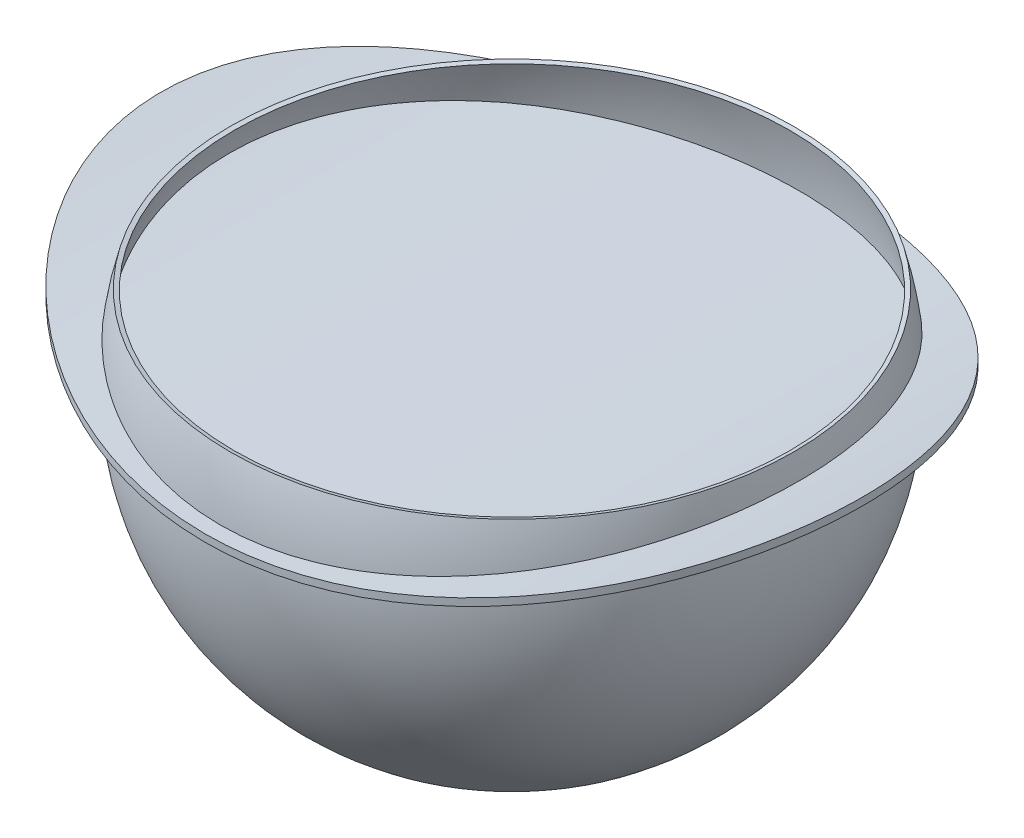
ISO-10303-21;
HEADER;
FILE_DESCRIPTION(('STEP AP214'),'2;1');
FILE_NAME('part.step','',(''),(''),'','','');
FILE_SCHEMA(('AUTOMOTIVE_DESIGN { 1 0 10303 214 1 1 1 1 }'));
ENDSEC;
DATA;
#1=APPLICATION_CONTEXT('core data for automotive mechanical design processes');
#2=APPLICATION_PROTOCOL_DEFINITION('international standard','automotive_design',2000,#1);
#3=PRODUCT_CONTEXT('',#1,'mechanical');
#4=PRODUCT('Part','Part','',(#3));
#5=PRODUCT_RELATED_PRODUCT_CATEGORY('part','',(#4));
#6=PRODUCT_DEFINITION_FORMATION('','',#4);
#7=PRODUCT_DEFINITION_CONTEXT('part definition',#1,'design');
#8=PRODUCT_DEFINITION('design','',#6,#7);
#9=PRODUCT_DEFINITION_SHAPE('','',#8);
#10=(LENGTH_UNIT() NAMED_UNIT(*) SI_UNIT(.MILLI.,.METRE.));
#11=(NAMED_UNIT(*) PLANE_ANGLE_UNIT() SI_UNIT($,.RADIAN.));
#12=(NAMED_UNIT(*) SI_UNIT($,.STERADIAN.) SOLID_ANGLE_UNIT());
#13=UNCERTAINTY_MEASURE_WITH_UNIT(LENGTH_MEASURE(1.E-05),#10,'distance_accuracy_value','');
#14=(GEOMETRIC_REPRESENTATION_CONTEXT(3) GLOBAL_UNCERTAINTY_ASSIGNED_CONTEXT((#13)) GLOBAL_UNIT_ASSIGNED_CONTEXT((#10,
#11,#12)) REPRESENTATION_CONTEXT('',''));
#15=CARTESIAN_POINT('',(0.,0.,0.));
#16=DIRECTION('',(0.,0.,1.));
#17=DIRECTION('',(1.,0.,0.));
#18=AXIS2_PLACEMENT_3D('',#15,#16,#17);
#19=CARTESIAN_POINT('',(0.,490.,105.));
#20=DIRECTION('',(0.,0.,-1.));
#21=DIRECTION('',(-1.,0.,0.));
#22=AXIS2_PLACEMENT_3D('',#19,#20,#21);
#23=CYLINDRICAL_SURFACE('',#22,400.);
#24=CARTESIAN_POINT('',(-2.85386398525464E-13,90.,105.));
#25=CARTESIAN_POINT('',(-1.92421500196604,90.0000002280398,104.999999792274));
#26=CARTESIAN_POINT('',(-3.84844061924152,90.0138933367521,104.959499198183));
#27=CARTESIAN_POINT('',(-7.69310145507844,90.0693654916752,104.797534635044));
#28=CARTESIAN_POINT('',(-9.61353662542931,90.1109448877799,104.676069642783));
#29=CARTESIAN_POINT('',(-13.4467615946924,90.2214850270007,104.352296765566));
#30=CARTESIAN_POINT('',(-15.3595514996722,90.2904453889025,104.149990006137));
#31=CARTESIAN_POINT('',(-19.1736870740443,90.4552424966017,103.664730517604));
#32=CARTESIAN_POINT('',(-21.0750329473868,90.5510787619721,103.38177923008));
#33=CARTESIAN_POINT('',(-24.7237184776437,90.7609385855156,102.759185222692));
#34=CARTESIAN_POINT('',(-26.4721350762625,90.8731151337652,102.42521509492));
#35=CARTESIAN_POINT('',(-29.9528805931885,91.1192297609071,101.688519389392));
#36=CARTESIAN_POINT('',(-31.6852095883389,91.2531677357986,101.285794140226));
#37=CARTESIAN_POINT('',(-35.1306516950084,91.5419397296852,100.411937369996));
#38=CARTESIAN_POINT('',(-36.8437659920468,91.6967724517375,99.9408100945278));
#39=CARTESIAN_POINT('',(-40.2478755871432,92.0263417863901,98.9304996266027));
#40=CARTESIAN_POINT('',(-41.9388708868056,92.2010783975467,98.3913164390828));
#41=CARTESIAN_POINT('',(-45.2671784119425,92.5661847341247,97.2550557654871));
#42=CARTESIAN_POINT('',(-46.9049145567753,92.7562382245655,96.6591182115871));
#43=CARTESIAN_POINT('',(-50.1533449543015,93.1532793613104,95.4022741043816));
#44=CARTESIAN_POINT('',(-51.7640369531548,93.3602684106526,94.741362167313));
#45=CARTESIAN_POINT('',(-54.955165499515,93.7898013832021,93.3551713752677));
#46=CARTESIAN_POINT('',(-56.5356052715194,94.0123436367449,92.6298994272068));
#47=CARTESIAN_POINT('',(-59.6636202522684,94.4715541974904,91.1153921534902));
#48=CARTESIAN_POINT('',(-61.2111926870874,94.7082236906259,90.3261514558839));
#49=CARTESIAN_POINT('',(-64.2169084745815,95.1855844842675,88.7130365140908));
#50=CARTESIAN_POINT('',(-65.6762871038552,95.425846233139,87.8913363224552));
#51=CARTESIAN_POINT('',(-68.5589698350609,95.9164993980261,86.189459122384));
#52=CARTESIAN_POINT('',(-69.9822710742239,96.1668916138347,85.3092774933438));
#53=CARTESIAN_POINT('',(-72.7899257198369,96.6761355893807,83.4911266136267));
#54=CARTESIAN_POINT('',(-74.1742791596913,96.9349873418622,82.5531574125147));
#55=CARTESIAN_POINT('',(-76.9012236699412,97.4593912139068,80.6201318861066));
#56=CARTESIAN_POINT('',(-78.2438153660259,97.7249432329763,79.6250764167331));
#57=CARTESIAN_POINT('',(-80.8121212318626,98.2462215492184,77.6346459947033));
#58=CARTESIAN_POINT('',(-82.0402108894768,98.5016904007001,76.6422678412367));
#59=CARTESIAN_POINT('',(-84.4539263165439,99.0152731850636,74.6080116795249));
#60=CARTESIAN_POINT('',(-85.6395562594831,99.2733868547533,73.5661385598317));
#61=CARTESIAN_POINT('',(-87.9655883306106,99.790473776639,71.4339387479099));
#62=CARTESIAN_POINT('',(-89.1060034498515,100.049446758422,70.343626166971));
#63=CARTESIAN_POINT('',(-91.3392462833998,100.566493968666,68.1153073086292));
#64=CARTESIAN_POINT('',(-92.4320790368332,100.824568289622,66.9773061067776));
#65=CARTESIAN_POINT('',(-94.49279253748,101.319983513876,64.7359373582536));
#66=CARTESIAN_POINT('',(-95.4640638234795,101.557510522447,63.635727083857));
#67=CARTESIAN_POINT('',(-97.3609820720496,102.028616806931,61.3959302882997));
#68=CARTESIAN_POINT('',(-98.2866318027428,102.262196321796,60.2563461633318));
#69=CARTESIAN_POINT('',(-100.091180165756,102.724098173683,57.9374791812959));
#70=CARTESIAN_POINT('',(-100.970022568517,102.952414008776,56.7581512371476));
#71=CARTESIAN_POINT('',(-102.677632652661,103.401909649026,54.3621378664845));
#72=CARTESIAN_POINT('',(-103.506390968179,103.623088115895,53.1454455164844));
#73=CARTESIAN_POINT('',(-105.315564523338,104.111778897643,50.3621401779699));
#74=CARTESIAN_POINT('',(-106.280922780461,104.376763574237,48.7852527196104));
#75=CARTESIAN_POINT('',(-108.124622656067,104.889649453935,45.5779785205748));
#76=CARTESIAN_POINT('',(-109.002934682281,105.137544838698,43.9475738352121));
#77=CARTESIAN_POINT('',(-110.667818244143,105.612976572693,40.637189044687));
#78=CARTESIAN_POINT('',(-111.454370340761,105.840508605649,38.9571985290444));
#79=CARTESIAN_POINT('',(-112.930483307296,106.271845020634,35.5537523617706));
#80=CARTESIAN_POINT('',(-113.620122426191,106.475668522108,33.8303331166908));
#81=CARTESIAN_POINT('',(-114.89885659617,106.856817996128,30.3440795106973));
#82=CARTESIAN_POINT('',(-115.487971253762,107.03414913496,28.5812529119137));
#83=CARTESIAN_POINT('',(-116.56172887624,107.359596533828,25.0223117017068));
#84=CARTESIAN_POINT('',(-117.046426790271,107.507728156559,23.2262151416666));
#85=CARTESIAN_POINT('',(-117.786494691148,107.735110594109,20.1181369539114));
#86=CARTESIAN_POINT('',(-118.067957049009,107.82199480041,18.8128616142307));
#87=CARTESIAN_POINT('',(-118.574562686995,107.978870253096,16.1906147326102));
#88=CARTESIAN_POINT('',(-118.799716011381,108.048864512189,14.8736453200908));
#89=CARTESIAN_POINT('',(-119.192720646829,108.171324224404,12.2315907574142));
#90=CARTESIAN_POINT('',(-119.360623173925,108.223805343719,10.9065139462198));
#91=CARTESIAN_POINT('',(-119.638762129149,108.310875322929,8.24966872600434));
#92=CARTESIAN_POINT('',(-119.748996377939,108.345463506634,6.91790006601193));
#93=CARTESIAN_POINT('',(-119.904063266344,108.394154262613,4.37027006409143));
#94=CARTESIAN_POINT('',(-119.953879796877,108.409817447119,3.15473903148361));
#95=CARTESIAN_POINT('',(-120.005207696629,108.425956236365,0.722639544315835));
#96=CARTESIAN_POINT('',(-120.006722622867,108.426432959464,-0.493928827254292));
#97=CARTESIAN_POINT('',(-119.961434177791,108.412192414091,-2.92683131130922));
#98=CARTESIAN_POINT('',(-119.914601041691,108.397465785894,-4.14316481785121));
#99=CARTESIAN_POINT('',(-119.772719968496,108.35291046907,-6.57292939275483));
#100=CARTESIAN_POINT('',(-119.677663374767,108.323079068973,-7.78635990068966));
#101=CARTESIAN_POINT('',(-119.398055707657,108.235500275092,-10.6309947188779));
#102=CARTESIAN_POINT('',(-119.193844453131,108.171642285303,-12.260119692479));
#103=CARTESIAN_POINT('',(-118.699279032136,108.017607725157,-15.5045802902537));
#104=CARTESIAN_POINT('',(-118.408890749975,107.927420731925,-17.1199101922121));
#105=CARTESIAN_POINT('',(-117.743629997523,107.721882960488,-20.3315918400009));
#106=CARTESIAN_POINT('',(-117.368750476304,107.606530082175,-21.9279419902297));
#107=CARTESIAN_POINT('',(-116.536037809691,107.351935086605,-25.0991365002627));
#108=CARTESIAN_POINT('',(-116.078097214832,107.212662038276,-26.6739501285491));
#109=CARTESIAN_POINT('',(-115.08204604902,106.912029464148,-29.7956794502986));
#110=CARTESIAN_POINT('',(-114.543942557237,106.750671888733,-31.3425975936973));
#111=CARTESIAN_POINT('',(-113.39020129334,106.407736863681,-34.4049400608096));
#112=CARTESIAN_POINT('',(-112.774564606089,106.226159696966,-35.9203648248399));
#113=CARTESIAN_POINT('',(-111.613645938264,105.88715993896,-38.583694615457));
#114=CARTESIAN_POINT('',(-111.083083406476,105.733323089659,-39.7385071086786));
#115=CARTESIAN_POINT('',(-109.978157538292,105.415632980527,-42.0256793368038));
#116=CARTESIAN_POINT('',(-109.403791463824,105.251779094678,-43.158037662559));
#117=CARTESIAN_POINT('',(-108.212759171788,104.915098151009,-45.3988656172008));
#118=CARTESIAN_POINT('',(-107.596094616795,104.742271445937,-46.5073361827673));
#119=CARTESIAN_POINT('',(-106.3219116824,104.38868222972,-48.6992847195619));
#120=CARTESIAN_POINT('',(-105.664389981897,104.207919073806,-49.7827606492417));
#121=CARTESIAN_POINT('',(-103.632560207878,103.655254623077,-52.9943212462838));
#122=CARTESIAN_POINT('',(-102.198986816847,103.272978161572,-55.0835399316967));
#123=CARTESIAN_POINT('',(-99.1862885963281,102.489351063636,-59.1499498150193));
#124=CARTESIAN_POINT('',(-97.6071593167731,102.087999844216,-61.1271375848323));
#125=CARTESIAN_POINT('',(-94.1083891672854,101.223392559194,-65.2043975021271));
#126=CARTESIAN_POINT('',(-92.1708715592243,100.758678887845,-67.2888460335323));
#127=CARTESIAN_POINT('',(-88.1415891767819,99.8265300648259,-71.3024713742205));
#128=CARTESIAN_POINT('',(-86.0498025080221,99.3590945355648,-73.2316260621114));
#129=CARTESIAN_POINT('',(-81.7284542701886,98.432201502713,-76.9283080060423));
#130=CARTESIAN_POINT('',(-79.4989635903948,97.9727400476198,-78.6959172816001));
#131=CARTESIAN_POINT('',(-74.9159883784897,97.0711958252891,-82.0661889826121));
#132=CARTESIAN_POINT('',(-72.5625337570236,96.6291089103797,-83.6688909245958));
#133=CARTESIAN_POINT('',(-68.8001229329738,95.9588377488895,-86.0411567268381));
#134=CARTESIAN_POINT('',(-67.4286767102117,95.7217299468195,-86.8683174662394));
#135=CARTESIAN_POINT('',(-64.6533824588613,95.257148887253,-88.4689536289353));
#136=CARTESIAN_POINT('',(-63.2495388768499,95.0296743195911,-89.2424363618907));
#137=CARTESIAN_POINT('',(-60.4126152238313,94.5858169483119,-90.7348152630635));
#138=CARTESIAN_POINT('',(-58.9795544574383,94.3694271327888,-91.4537460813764));
#139=CARTESIAN_POINT('',(-56.0855721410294,93.9488081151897,-92.8371591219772));
#140=CARTESIAN_POINT('',(-54.6246495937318,93.7445793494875,-93.5016393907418));
#141=CARTESIAN_POINT('',(-51.6772870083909,93.3494373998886,-94.7757082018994));
#142=CARTESIAN_POINT('',(-50.1908468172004,93.1585242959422,-95.385296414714));
#143=CARTESIAN_POINT('',(-47.1946171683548,92.7910545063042,-96.5492423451));
#144=CARTESIAN_POINT('',(-45.6848258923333,92.6144989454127,-97.1035957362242));
#145=CARTESIAN_POINT('',(-42.6441379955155,92.276707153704,-98.1567158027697));
#146=CARTESIAN_POINT('',(-41.1132394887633,92.1154723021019,-98.65547747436));
#147=CARTESIAN_POINT('',(-38.0326111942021,91.8091956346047,-99.5970753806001));
#148=CARTESIAN_POINT('',(-36.4828799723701,91.664155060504,-100.039907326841));
#149=CARTESIAN_POINT('',(-33.3673126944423,91.3910848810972,-100.869220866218));
#150=CARTESIAN_POINT('',(-31.801480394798,91.2630514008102,-101.255715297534));
#151=CARTESIAN_POINT('',(-28.6554967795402,91.0246233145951,-101.972248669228));
#152=CARTESIAN_POINT('',(-27.0753443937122,90.914230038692,-102.302283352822));
#153=CARTESIAN_POINT('',(-23.9032804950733,90.7116848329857,-102.905607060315));
#154=CARTESIAN_POINT('',(-22.3113704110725,90.6195307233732,-103.178902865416));
#155=CARTESIAN_POINT('',(-19.1177398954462,90.4539214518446,-103.66863353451));
#156=CARTESIAN_POINT('',(-17.5160187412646,90.3804676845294,-103.885064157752));
#157=CARTESIAN_POINT('',(-14.3052843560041,90.2526549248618,-104.260874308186));
#158=CARTESIAN_POINT('',(-12.6962717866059,90.1982942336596,-104.420258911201));
#159=CARTESIAN_POINT('',(-9.47295315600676,90.1089363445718,-104.681904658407));
#160=CARTESIAN_POINT('',(-7.85864671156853,90.0739405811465,-104.78416157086));
#161=CARTESIAN_POINT('',(-4.62722500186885,90.0235009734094,-104.931458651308));
#162=CARTESIAN_POINT('',(-3.01010992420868,90.0080558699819,-104.97650250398));
#163=CARTESIAN_POINT('',(0.224888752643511,89.9967925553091,-105.009355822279));
#164=CARTESIAN_POINT('',(1.84277239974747,90.0009757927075,-104.997161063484));
#165=CARTESIAN_POINT('',(5.07680385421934,90.0289501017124,-104.915538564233));
#166=CARTESIAN_POINT('',(6.69295178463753,90.0527396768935,-104.846115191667));
#167=CARTESIAN_POINT('',(9.92148431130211,90.1198036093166,-104.650083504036));
#168=CARTESIAN_POINT('',(11.5338686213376,90.1630794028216,-104.523470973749));
#169=CARTESIAN_POINT('',(14.7524011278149,90.2688922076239,-104.213151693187));
#170=CARTESIAN_POINT('',(16.3585497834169,90.3314277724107,-104.029449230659));
#171=CARTESIAN_POINT('',(19.5624841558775,90.4754295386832,-103.605081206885));
#172=CARTESIAN_POINT('',(21.1602692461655,90.5568971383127,-103.364411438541));
#173=CARTESIAN_POINT('',(25.9375550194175,90.8290982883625,-102.557169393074));
#174=CARTESIAN_POINT('',(29.1015613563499,91.0476493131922,-101.905308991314));
#175=CARTESIAN_POINT('',(35.3686209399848,91.5543348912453,-100.376061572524));
#176=CARTESIAN_POINT('',(38.4716740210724,91.842469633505,-99.4986739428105));
#177=CARTESIAN_POINT('',(44.5994053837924,92.4822223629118,-97.5205427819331));
#178=CARTESIAN_POINT('',(47.6240763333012,92.8338462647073,-96.4197784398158));
#179=CARTESIAN_POINT('',(53.576919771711,93.592994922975,-93.9975084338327));
#180=CARTESIAN_POINT('',(56.5050923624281,94.0005196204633,-92.6760030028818));
#181=CARTESIAN_POINT('',(60.8106708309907,94.6467732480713,-90.5309724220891));
#182=CARTESIAN_POINT('',(62.2317108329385,94.8680698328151,-89.7886577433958));
#183=CARTESIAN_POINT('',(65.0426067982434,95.3210362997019,-88.2501878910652));
#184=CARTESIAN_POINT('',(66.4324653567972,95.5527053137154,-87.4540372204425));
#185=CARTESIAN_POINT('',(69.1787975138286,96.0250820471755,-85.808303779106));
#186=CARTESIAN_POINT('',(70.5352674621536,96.2657907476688,-84.9587152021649));
#187=CARTESIAN_POINT('',(73.2121660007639,96.7547461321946,-83.2068046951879));
#188=CARTESIAN_POINT('',(74.5325977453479,97.0029921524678,-82.3044874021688));
#189=CARTESIAN_POINT('',(77.1357262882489,97.505620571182,-80.4472049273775));
#190=CARTESIAN_POINT('',(78.4184039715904,97.7600059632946,-79.4922137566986));
#191=CARTESIAN_POINT('',(80.9427049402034,98.2731344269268,-77.5307648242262));
#192=CARTESIAN_POINT('',(82.1843320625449,98.5318770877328,-76.5243118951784));
#193=CARTESIAN_POINT('',(84.6241508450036,99.0520379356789,-74.4605575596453));
#194=CARTESIAN_POINT('',(85.8223398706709,99.3134562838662,-73.4032530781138));
#195=CARTESIAN_POINT('',(88.1724378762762,99.8371233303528,-71.2388185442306));
#196=CARTESIAN_POINT('',(89.3243517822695,100.099371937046,-70.1316938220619));
#197=CARTESIAN_POINT('',(91.5068737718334,100.606028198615,-67.9411990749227));
#198=CARTESIAN_POINT('',(92.5405210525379,100.850499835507,-66.860871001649));
#199=CARTESIAN_POINT('',(94.5626406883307,101.336921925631,-64.6583728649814));
#200=CARTESIAN_POINT('',(95.5511177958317,101.578872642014,-63.5362072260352));
#201=CARTESIAN_POINT('',(97.480743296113,102.058647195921,-61.2508820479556));
#202=CARTESIAN_POINT('',(98.4218881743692,102.296470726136,-60.0877194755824));
#203=CARTESIAN_POINT('',(100.254297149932,102.76625866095,-57.7217729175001));
#204=CARTESIAN_POINT('',(101.14556658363,102.998223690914,-56.5189931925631));
#205=CARTESIAN_POINT('',(102.812631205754,103.437908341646,-54.1644187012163));
#206=CARTESIAN_POINT('',(103.592104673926,103.646160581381,-53.0153265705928));
#207=CARTESIAN_POINT('',(105.104184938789,104.054766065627,-50.6854958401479));
#208=CARTESIAN_POINT('',(105.836796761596,104.255120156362,-49.5047606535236));
#209=CARTESIAN_POINT('',(107.253160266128,104.646526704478,-47.1131110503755));
#210=CARTESIAN_POINT('',(107.936920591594,104.837580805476,-45.9022020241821));
#211=CARTESIAN_POINT('',(109.253716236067,105.209026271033,-43.4516535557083));
#212=CARTESIAN_POINT('',(109.886756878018,105.389418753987,-42.2120171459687));
#213=CARTESIAN_POINT('',(111.059894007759,105.726598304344,-39.7890137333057));
#214=CARTESIAN_POINT('',(111.603372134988,105.884157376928,-38.6073907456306));
#215=CARTESIAN_POINT('',(112.642979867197,106.187738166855,-36.2221141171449));
#216=CARTESIAN_POINT('',(113.139112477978,106.333760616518,-35.0184618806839));
#217=CARTESIAN_POINT('',(114.082952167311,106.613351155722,-32.5898463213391));
#218=CARTESIAN_POINT('',(114.530623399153,106.746910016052,-31.3648679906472));
#219=CARTESIAN_POINT('',(115.375811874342,107.000500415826,-28.8960905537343));
#220=CARTESIAN_POINT('',(115.773319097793,107.120529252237,-27.6522877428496));
#221=CARTESIAN_POINT('',(116.623055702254,107.378368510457,-24.7900998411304));
#222=CARTESIAN_POINT('',(117.05845594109,107.511456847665,-23.1662543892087));
#223=CARTESIAN_POINT('',(117.841692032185,107.752039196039,-19.8951305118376));
#224=CARTESIAN_POINT('',(118.18949756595,107.859524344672,-18.2478441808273));
#225=CARTESIAN_POINT('',(118.795341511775,108.047427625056,-14.9351513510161));
#226=CARTESIAN_POINT('',(119.053372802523,108.127843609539,-13.2697434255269));
#227=CARTESIAN_POINT('',(119.478206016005,108.260549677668,-9.92495205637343));
#228=CARTESIAN_POINT('',(119.644940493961,108.312818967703,-8.24555920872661));
#229=CARTESIAN_POINT('',(119.88583831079,108.388415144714,-4.87961594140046));
#230=CARTESIAN_POINT('',(119.960007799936,108.411743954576,-3.19306600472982));
#231=CARTESIAN_POINT('',(120.015314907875,108.429134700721,0.181681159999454));
#232=CARTESIAN_POINT('',(119.996457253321,108.423198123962,1.86987830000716));
#233=CARTESIAN_POINT('',(119.882790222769,108.387475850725,4.80515963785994));
#234=CARTESIAN_POINT('',(119.80892973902,108.364269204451,6.05318338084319));
#235=CARTESIAN_POINT('',(119.610492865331,108.302029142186,8.54490291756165));
#236=CARTESIAN_POINT('',(119.485913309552,108.262994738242,9.78859843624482));
#237=CARTESIAN_POINT('',(119.186467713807,108.169395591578,12.269291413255));
#238=CARTESIAN_POINT('',(119.011602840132,108.114831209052,13.5062890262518));
#239=CARTESIAN_POINT('',(118.612174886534,107.990581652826,15.9714760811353));
#240=CARTESIAN_POINT('',(118.387611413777,107.920896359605,17.1996654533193));
#241=CARTESIAN_POINT('',(117.88948685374,107.766907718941,19.6453454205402));
#242=CARTESIAN_POINT('',(117.615917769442,107.682601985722,20.8628342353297));
#243=CARTESIAN_POINT('',(117.020682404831,107.4999911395,23.2849338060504));
#244=CARTESIAN_POINT('',(116.699015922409,107.401685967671,24.4895445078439));
#245=CARTESIAN_POINT('',(116.008602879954,107.191778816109,26.8839413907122));
#246=CARTESIAN_POINT('',(115.639859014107,107.080177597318,28.0737284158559));
#247=CARTESIAN_POINT('',(114.856343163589,106.844433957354,30.4368927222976));
#248=CARTESIAN_POINT('',(114.441567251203,106.720290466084,31.6102685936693));
#249=CARTESIAN_POINT('',(113.562743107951,106.458977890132,33.9507357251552));
#250=CARTESIAN_POINT('',(113.098236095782,106.321689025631,35.1176412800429));
#251=CARTESIAN_POINT('',(112.124737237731,106.036068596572,37.4314802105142));
#252=CARTESIAN_POINT('',(111.61574140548,105.887736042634,38.5784117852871));
#253=CARTESIAN_POINT('',(110.554651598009,105.580991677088,40.8507535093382));
#254=CARTESIAN_POINT('',(110.002558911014,105.422580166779,41.976164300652));
#255=CARTESIAN_POINT('',(108.856643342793,105.096653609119,44.2042269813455));
#256=CARTESIAN_POINT('',(108.262817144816,104.929137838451,45.306877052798));
#257=CARTESIAN_POINT('',(106.42186139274,104.414717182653,48.5770343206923));
#258=CARTESIAN_POINT('',(105.114230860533,104.055640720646,50.7089342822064));
#259=CARTESIAN_POINT('',(102.349634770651,103.313306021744,54.8682352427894));
#260=CARTESIAN_POINT('',(100.892699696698,102.930052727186,56.8956574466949));
#261=CARTESIAN_POINT('',(98.5250512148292,102.322853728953,59.955502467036));
#262=CARTESIAN_POINT('',(97.6623026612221,102.104521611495,61.0264924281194));
#263=CARTESIAN_POINT('',(95.896758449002,101.664269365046,63.1337872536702));
#264=CARTESIAN_POINT('',(94.9939701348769,101.442349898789,64.1700984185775));
#265=CARTESIAN_POINT('',(92.2281153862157,100.773112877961,67.2259204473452));
#266=CARTESIAN_POINT('',(90.3071422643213,100.322208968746,69.1928571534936));
#267=CARTESIAN_POINT('',(86.9777095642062,99.5684879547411,72.3598713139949));
#268=CARTESIAN_POINT('',(85.6072082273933,99.2654892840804,73.6002896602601));
#269=CARTESIAN_POINT('',(82.8066905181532,98.6624176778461,76.0138586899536));
#270=CARTESIAN_POINT('',(81.3766561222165,98.3623456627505,77.1869887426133));
#271=CARTESIAN_POINT('',(78.4613993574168,97.7678972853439,79.4643959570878));
#272=CARTESIAN_POINT('',(76.9761698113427,97.4735216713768,80.5686641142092));
#273=CARTESIAN_POINT('',(73.9535848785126,96.8928428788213,82.7078578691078));
#274=CARTESIAN_POINT('',(72.4161962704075,96.6065450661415,83.7427379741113));
#275=CARTESIAN_POINT('',(69.2942464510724,96.0446437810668,85.7412846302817));
#276=CARTESIAN_POINT('',(67.709691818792,95.7690388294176,86.7049610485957));
#277=CARTESIAN_POINT('',(64.4972507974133,95.2307556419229,88.5602349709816));
#278=CARTESIAN_POINT('',(62.8693736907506,94.968074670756,89.4518477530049));
#279=CARTESIAN_POINT('',(59.7529490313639,94.4854062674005,91.0693880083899));
#280=CARTESIAN_POINT('',(58.2685096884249,94.2638830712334,91.8027879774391));
#281=CARTESIAN_POINT('',(55.2705772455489,93.8340549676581,93.2113546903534));
#282=CARTESIAN_POINT('',(53.7570874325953,93.6257485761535,93.8865279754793));
#283=CARTESIAN_POINT('',(50.7045726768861,93.2237224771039,95.1777929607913));
#284=CARTESIAN_POINT('',(49.1655677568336,93.0299919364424,95.7939286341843));
#285=CARTESIAN_POINT('',(46.0633552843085,92.6580717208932,96.9673047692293));
#286=CARTESIAN_POINT('',(44.5001467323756,92.4798826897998,97.5245427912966));
#287=CARTESIAN_POINT('',(41.231665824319,92.1270880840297,98.6200775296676));
#288=CARTESIAN_POINT('',(39.5246714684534,91.9537986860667,99.1536667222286));
#289=CARTESIAN_POINT('',(36.0884714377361,91.6275597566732,100.151767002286));
#290=CARTESIAN_POINT('',(34.3592630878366,91.4746127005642,100.616269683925));
#291=CARTESIAN_POINT('',(30.8814512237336,91.1900442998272,101.475866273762));
#292=CARTESIAN_POINT('',(29.1328426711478,91.0584286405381,101.87094168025));
#293=CARTESIAN_POINT('',(25.6199767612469,90.8174401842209,102.591169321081));
#294=CARTESIAN_POINT('',(23.8557211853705,90.7080648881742,102.916329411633));
#295=CARTESIAN_POINT('',(20.2626916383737,90.5093812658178,103.504995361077));
#296=CARTESIAN_POINT('',(18.4335389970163,90.4207528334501,103.766421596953));
#297=CARTESIAN_POINT('',(14.7650897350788,90.2683870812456,104.214748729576));
#298=CARTESIAN_POINT('',(12.925793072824,90.2046498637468,104.401649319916));
#299=CARTESIAN_POINT('',(9.24044190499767,90.1024978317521,104.700756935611));
#300=CARTESIAN_POINT('',(7.39438742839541,90.0640829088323,104.812964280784));
#301=CARTESIAN_POINT('',(3.69889191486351,90.0128338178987,104.962586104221));
#302=CARTESIAN_POINT('',(1.84945086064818,89.9999997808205,105.000000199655));
#303=CARTESIAN_POINT('',(-2.85386398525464E-13,90.,105.));
#304=B_SPLINE_CURVE_WITH_KNOTS('',3,(#24,#25,#26,#27,#28,#29,#30,#31,#32,#33,#34,#35,#36,#37,
#38,#39,#40,#41,#42,#43,#44,#45,#46,#47,#48,#49,#50,#51,#52,#53,#54,#55,#56,#57,#58,#59,#60,#61,
#62,#63,#64,#65,#66,#67,#68,#69,#70,#71,#72,#73,#74,#75,#76,#77,#78,#79,#80,#81,#82,#83,#84,#85,
#86,#87,#88,#89,#90,#91,#92,#93,#94,#95,#96,#97,#98,#99,#100,#101,#102,#103,#104,#105,#106,#107,
#108,#109,#110,#111,#112,#113,#114,#115,#116,#117,#118,#119,#120,#121,#122,#123,#124,#125,#126,
#127,#128,#129,#130,#131,#132,#133,#134,#135,#136,#137,#138,#139,#140,#141,#142,#143,#144,#145,
#146,#147,#148,#149,#150,#151,#152,#153,#154,#155,#156,#157,#158,#159,#160,#161,#162,#163,#164,
#165,#166,#167,#168,#169,#170,#171,#172,#173,#174,#175,#176,#177,#178,#179,#180,#181,#182,#183,
#184,#185,#186,#187,#188,#189,#190,#191,#192,#193,#194,#195,#196,#197,#198,#199,#200,#201,#202,
#203,#204,#205,#206,#207,#208,#209,#210,#211,#212,#213,#214,#215,#216,#217,#218,#219,#220,#221,
#222,#223,#224,#225,#226,#227,#228,#229,#230,#231,#232,#233,#234,#235,#236,#237,#238,#239,#240,
#241,#242,#243,#244,#245,#246,#247,#248,#249,#250,#251,#252,#253,#254,#255,#256,#257,#258,#259,
#260,#261,#262,#263,#264,#265,#266,#267,#268,#269,#270,#271,#272,#273,#274,#275,#276,#277,#278,
#279,#280,#281,#282,#283,#284,#285,#286,#287,#288,#289,#290,#291,#292,#293,#294,#295,#296,#297,
#298,#299,#300,#301,#302,#303),.UNSPECIFIED.,.T.,.F.,(4,2,2,2,2,2,2,2,2,2,2,2,2,2,2,2,2,2,2,2,2,
2,2,2,2,2,2,2,2,2,2,2,2,2,2,2,2,2,2,2,2,2,2,2,2,2,2,2,2,2,2,2,2,2,2,2,2,2,2,2,2,2,2,2,2,2,2,2,2,
2,2,2,2,2,2,2,2,2,2,2,2,2,2,2,2,2,2,2,2,2,2,2,2,2,2,2,2,2,2,2,2,2,2,2,2,2,2,2,2,2,2,2,2,2,2,2,2,
2,2,2,2,2,2,2,2,2,2,2,2,2,2,2,2,2,2,2,2,2,2,4),(0.,5.7721875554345,11.5444480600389,
17.3166282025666,23.0887051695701,28.4378744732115,33.7870182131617,39.1358300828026,
44.4846415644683,49.7425299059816,55.0008542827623,60.2586150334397,65.5168177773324,
70.5912726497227,75.6661289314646,80.7409808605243,85.81575671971,90.6128480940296,
95.4094666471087,100.204696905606,104.999418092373,109.458300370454,113.916911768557,
118.380763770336,122.845447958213,128.44597750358,134.048404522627,139.652016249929,
145.251077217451,150.849044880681,156.444059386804,160.457123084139,164.469470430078,
168.478218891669,172.487118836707,176.13604068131,179.784693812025,183.435594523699,
187.08715084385,192.013826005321,196.942454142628,201.871493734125,206.806955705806,
211.741982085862,216.676939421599,220.516405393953,224.356111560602,228.195666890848,
232.035534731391,239.71526627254,247.395232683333,256.037065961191,264.680128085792,
273.318777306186,281.955351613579,286.811394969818,291.666775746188,296.519046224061,
301.371490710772,306.223964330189,311.07681773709,315.930107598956,320.783769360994,
325.636323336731,330.489243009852,335.341582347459,340.19428344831,345.046552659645,
349.899181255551,354.751497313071,359.604171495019,364.456475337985,369.309136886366,
374.161434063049,379.014089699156,388.717670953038,398.421278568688,408.125790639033,
417.830292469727,422.684615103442,427.53853220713,432.392977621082,437.24699677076,
442.103432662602,446.959413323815,451.815688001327,456.671444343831,461.21530395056,
465.758684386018,470.302401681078,474.845631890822,479.056662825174,483.267241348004,
487.477073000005,491.686462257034,495.61577414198,499.544836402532,503.476785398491,
507.409518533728,512.466219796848,517.524668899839,522.583519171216,527.646101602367,
532.708347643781,537.770336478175,541.520537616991,545.270972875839,549.021321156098,
552.771699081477,556.522689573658,560.273695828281,564.02448751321,567.77559948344,
571.564913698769,575.354567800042,579.144108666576,582.933951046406,590.506358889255,
598.077223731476,602.253755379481,606.42952406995,614.77900097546,620.396600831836,
626.015913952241,631.635960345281,637.25965608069,642.882571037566,648.504290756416,
653.514436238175,658.52401813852,663.529839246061,668.535867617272,673.924733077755,
679.314253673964,684.705208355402,690.095556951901,695.64344240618,701.191350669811,
706.739235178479,712.287148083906),.UNSPECIFIED.);
#305=CARTESIAN_POINT('',(-2.85386398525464E-13,90.,105.));
#306=VERTEX_POINT('',#305);
#307=EDGE_CURVE('E12',#306,#306,#304,.T.);
#308=ORIENTED_EDGE('',*,*,#307,.F.);
#309=EDGE_LOOP('',(#308));
#310=FACE_BOUND('',#309,.T.);
#311=ADVANCED_FACE('F41',(#310),#23,.F.);
#312=CARTESIAN_POINT('',(0.,110.,0.));
#313=DIRECTION('',(0.,1.,0.));
#314=DIRECTION('',(-1.,0.,0.));
#315=AXIS2_PLACEMENT_3D('',#312,#313,#314);
#316=ELLIPSE('',#315,120.,105.);
#317=DIRECTION('',(0.,-1.,0.));
#318=VECTOR('',#317,1.);
#319=SURFACE_OF_LINEAR_EXTRUSION('',#316,#318);
#320=CARTESIAN_POINT('',(-2.86267000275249E-13,87.5,105.));
#321=CARTESIAN_POINT('',(-1.92419855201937,87.5000002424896,104.99999977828));
#322=CARTESIAN_POINT('',(-3.84840848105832,87.5138068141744,104.959499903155));
#323=CARTESIAN_POINT('',(-7.69304361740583,87.5689335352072,104.797537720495));
#324=CARTESIAN_POINT('',(-9.61346877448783,87.6102540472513,104.676074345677));
#325=CARTESIAN_POINT('',(-13.4466882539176,87.7201061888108,104.352303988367));
#326=CARTESIAN_POINT('',(-15.359482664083,87.7886375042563,104.149997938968));
#327=CARTESIAN_POINT('',(-19.1736411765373,87.9524095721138,103.664737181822));
#328=CARTESIAN_POINT('',(-21.0750054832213,88.0476498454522,103.381783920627));
#329=CARTESIAN_POINT('',(-24.7244642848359,88.2562461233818,102.759057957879));
#330=CARTESIAN_POINT('',(-26.4736290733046,88.3677757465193,102.424929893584));
#331=CARTESIAN_POINT('',(-29.9558733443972,88.6124790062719,101.687854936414));
#332=CARTESIAN_POINT('',(-31.6889529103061,88.7456525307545,101.284908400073));
#333=CARTESIAN_POINT('',(-35.1358968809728,89.0327824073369,100.410543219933));
#334=CARTESIAN_POINT('',(-36.8497624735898,89.1867374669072,99.9391288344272));
#335=CARTESIAN_POINT('',(-40.2553725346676,89.5144430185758,98.9281757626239));
#336=CARTESIAN_POINT('',(-41.9471170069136,89.6881935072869,98.388637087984));
#337=CARTESIAN_POINT('',(-45.2763830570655,90.0511852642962,97.2517791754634));
#338=CARTESIAN_POINT('',(-46.9143363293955,90.2401063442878,96.6556217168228));
#339=CARTESIAN_POINT('',(-50.1632088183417,90.6347781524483,95.398307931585));
#340=CARTESIAN_POINT('',(-51.7741257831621,90.8405302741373,94.7371462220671));
#341=CARTESIAN_POINT('',(-54.9657089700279,91.2674922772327,93.3504238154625));
#342=CARTESIAN_POINT('',(-56.546378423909,91.4887004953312,92.6248700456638));
#343=CARTESIAN_POINT('',(-59.6748543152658,91.945153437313,91.1097648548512));
#344=CARTESIAN_POINT('',(-61.2226579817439,92.1803993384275,90.3202080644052));
#345=CARTESIAN_POINT('',(-64.2283653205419,92.654810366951,88.7066838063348));
#346=CARTESIAN_POINT('',(-65.6875148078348,92.8935451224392,87.8849099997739));
#347=CARTESIAN_POINT('',(-68.5697553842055,93.381070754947,86.1828877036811));
#348=CARTESIAN_POINT('',(-69.992843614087,93.6298624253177,85.3026345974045));
#349=CARTESIAN_POINT('',(-72.8000853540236,94.1358417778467,83.4843424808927));
#350=CARTESIAN_POINT('',(-74.1842389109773,94.3930294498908,82.5463035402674));
#351=CARTESIAN_POINT('',(-76.9107942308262,94.9140523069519,80.6131399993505));
#352=CARTESIAN_POINT('',(-78.2531966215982,95.1778873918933,79.6180162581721));
#353=CARTESIAN_POINT('',(-80.8209599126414,95.6957487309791,77.627595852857));
#354=CARTESIAN_POINT('',(-82.0487017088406,95.9495191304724,76.6353031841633));
#355=CARTESIAN_POINT('',(-84.4617378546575,96.45967752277,74.6012355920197));
#356=CARTESIAN_POINT('',(-85.6470363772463,96.7160652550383,73.5594655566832));
#357=CARTESIAN_POINT('',(-87.9724210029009,97.2296846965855,71.4274905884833));
#358=CARTESIAN_POINT('',(-89.1125200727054,97.4869161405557,70.3372997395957));
#359=CARTESIAN_POINT('',(-91.345144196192,98.0004763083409,68.1092456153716));
#360=CARTESIAN_POINT('',(-92.4376742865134,98.2568051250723,66.9713874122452));
#361=CARTESIAN_POINT('',(-94.4979016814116,98.7488805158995,64.7302241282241));
#362=CARTESIAN_POINT('',(-95.4689849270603,98.9848124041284,63.6300711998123));
#363=CARTESIAN_POINT('',(-97.3655293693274,99.4527460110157,61.390405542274));
#364=CARTESIAN_POINT('',(-98.2909933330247,99.684747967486,60.2508952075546));
#365=CARTESIAN_POINT('',(-100.095170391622,100.14352090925,57.9321971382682));
#366=CARTESIAN_POINT('',(-100.973827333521,100.370285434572,56.7529643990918));
#367=CARTESIAN_POINT('',(-102.68106865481,100.816718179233,54.3571642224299));
#368=CARTESIAN_POINT('',(-103.509643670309,101.036385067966,53.1405898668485));
#369=CARTESIAN_POINT('',(-105.318651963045,101.521792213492,50.3572034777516));
#370=CARTESIAN_POINT('',(-106.284009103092,101.785016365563,48.780110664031));
#371=CARTESIAN_POINT('',(-108.127671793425,102.294477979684,45.5724465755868));
#372=CARTESIAN_POINT('',(-109.005947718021,102.540709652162,43.9418573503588));
#373=CARTESIAN_POINT('',(-110.670725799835,103.012933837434,40.6311322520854));
#374=CARTESIAN_POINT('',(-111.457208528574,103.238922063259,38.9509859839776));
#375=CARTESIAN_POINT('',(-112.93315670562,103.667316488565,35.5472559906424));
#376=CARTESIAN_POINT('',(-113.622700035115,103.869741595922,33.8237084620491));
#377=CARTESIAN_POINT('',(-114.901218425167,104.248260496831,30.3372361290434));
#378=CARTESIAN_POINT('',(-115.490213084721,104.424359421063,28.5743190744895));
#379=CARTESIAN_POINT('',(-116.563713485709,104.747530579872,25.0152355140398));
#380=CARTESIAN_POINT('',(-117.048274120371,104.89461806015,23.2190870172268));
#381=CARTESIAN_POINT('',(-117.78813830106,105.120397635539,20.1107799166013));
#382=CARTESIAN_POINT('',(-118.069529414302,105.206670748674,18.8053165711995));
#383=CARTESIAN_POINT('',(-118.575974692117,105.362432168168,16.1827090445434));
#384=CARTESIAN_POINT('',(-118.801038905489,105.431923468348,14.8655669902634));
#385=CARTESIAN_POINT('',(-119.193849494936,105.553490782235,12.2231823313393));
#386=CARTESIAN_POINT('',(-119.361647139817,105.605582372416,10.8979480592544));
#387=CARTESIAN_POINT('',(-119.639562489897,105.691990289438,8.24080025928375));
#388=CARTESIAN_POINT('',(-119.749678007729,105.726305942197,6.90888648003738));
#389=CARTESIAN_POINT('',(-119.904543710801,105.774602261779,4.36037233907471));
#390=CARTESIAN_POINT('',(-119.954254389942,105.790125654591,3.14409980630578));
#391=CARTESIAN_POINT('',(-120.005311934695,105.806070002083,0.7105239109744));
#392=CARTESIAN_POINT('',(-120.006662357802,105.806492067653,-0.506779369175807));
#393=CARTESIAN_POINT('',(-119.960986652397,105.792227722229,-2.94114579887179));
#394=CARTESIAN_POINT('',(-119.913930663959,105.777531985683,-4.15820833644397));
#395=CARTESIAN_POINT('',(-119.77154607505,105.733123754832,-6.58942206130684));
#396=CARTESIAN_POINT('',(-119.676208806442,105.703408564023,-7.80357268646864));
#397=CARTESIAN_POINT('',(-119.395873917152,105.61620174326,-10.6498925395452));
#398=CARTESIAN_POINT('',(-119.191192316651,105.552634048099,-12.2799782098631));
#399=CARTESIAN_POINT('',(-118.69558234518,105.399329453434,-15.5263384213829));
#400=CARTESIAN_POINT('',(-118.40461981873,105.30958219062,-17.1426072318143));
#401=CARTESIAN_POINT('',(-117.738108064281,105.105067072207,-20.3561409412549));
#402=CARTESIAN_POINT('',(-117.362551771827,104.99029712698,-21.9534042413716));
#403=CARTESIAN_POINT('',(-116.528384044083,104.737004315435,-25.1263945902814));
#404=CARTESIAN_POINT('',(-116.069665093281,104.59845071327,-26.7020908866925));
#405=CARTESIAN_POINT('',(-115.071958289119,104.299383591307,-29.8255499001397));
#406=CARTESIAN_POINT('',(-114.532977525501,104.138872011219,-31.3733150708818));
#407=CARTESIAN_POINT('',(-113.377385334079,103.797745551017,-34.4373103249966));
#408=CARTESIAN_POINT('',(-112.760774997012,103.617130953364,-35.9535408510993));
#409=CARTESIAN_POINT('',(-111.598107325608,103.279955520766,-38.6181126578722));
#410=CARTESIAN_POINT('',(-111.066793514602,103.126960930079,-39.7733735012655));
#411=CARTESIAN_POINT('',(-109.960321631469,102.811016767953,-42.0614166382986));
#412=CARTESIAN_POINT('',(-109.385160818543,102.648066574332,-43.1941975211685));
#413=CARTESIAN_POINT('',(-108.192497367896,102.313248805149,-45.4358420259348));
#414=CARTESIAN_POINT('',(-107.574996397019,102.141381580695,-46.5447065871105));
#415=CARTESIAN_POINT('',(-106.299100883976,101.789761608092,-48.7374119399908));
#416=CARTESIAN_POINT('',(-105.640703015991,101.610008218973,-49.821250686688));
#417=CARTESIAN_POINT('',(-103.606189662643,101.06044092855,-53.0338465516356));
#418=CARTESIAN_POINT('',(-102.170752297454,100.680319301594,-55.1236872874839));
#419=CARTESIAN_POINT('',(-99.1541980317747,99.9011382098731,-59.1911845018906));
#420=CARTESIAN_POINT('',(-97.5730766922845,99.5020781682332,-61.168837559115));
#421=CARTESIAN_POINT('',(-94.0707039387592,98.6426246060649,-65.2460379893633));
#422=CARTESIAN_POINT('',(-92.1316300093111,98.1807918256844,-67.3299978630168));
#423=CARTESIAN_POINT('',(-88.0992608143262,97.2544715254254,-71.3425297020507));
#424=CARTESIAN_POINT('',(-86.0059436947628,96.7899836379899,-73.2710795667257));
#425=CARTESIAN_POINT('',(-81.681585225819,95.8689894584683,-76.9664271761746));
#426=CARTESIAN_POINT('',(-79.45061476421,95.4124792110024,-78.7333070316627));
#427=CARTESIAN_POINT('',(-74.8647538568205,94.5167853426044,-82.1019922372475));
#428=CARTESIAN_POINT('',(-72.5098932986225,94.0775975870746,-83.7038371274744));
#429=CARTESIAN_POINT('',(-68.7456258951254,93.4118207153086,-86.0744998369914));
#430=CARTESIAN_POINT('',(-67.3737024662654,93.1763421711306,-86.9009678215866));
#431=CARTESIAN_POINT('',(-64.597500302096,92.7149740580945,-88.5002009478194));
#432=CARTESIAN_POINT('',(-63.1932260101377,92.4890831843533,-89.2729734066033));
#433=CARTESIAN_POINT('',(-60.3554898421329,92.0483376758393,-90.7639162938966));
#434=CARTESIAN_POINT('',(-58.9220472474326,91.8334760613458,-91.4821213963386));
#435=CARTESIAN_POINT('',(-56.027350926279,91.4158503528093,-92.864069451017));
#436=CARTESIAN_POINT('',(-54.566096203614,91.2130866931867,-93.5278104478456));
#437=CARTESIAN_POINT('',(-51.6181224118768,90.8208039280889,-94.8003885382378));
#438=CARTESIAN_POINT('',(-50.1314032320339,90.6312848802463,-95.4092253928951));
#439=CARTESIAN_POINT('',(-47.134666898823,90.2665241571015,-96.5716602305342));
#440=CARTESIAN_POINT('',(-45.6246479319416,90.0912835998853,-97.1252538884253));
#441=CARTESIAN_POINT('',(-42.5835556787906,89.7560354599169,-98.1768489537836));
#442=CARTESIAN_POINT('',(-41.0524805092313,89.5960292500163,-98.6748453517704));
#443=CARTESIAN_POINT('',(-37.9715495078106,89.2921167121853,-99.6149099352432));
#444=CARTESIAN_POINT('',(-36.4216922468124,89.1482116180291,-100.05697383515));
#445=CARTESIAN_POINT('',(-33.3059247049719,88.8773128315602,-100.884750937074));
#446=CARTESIAN_POINT('',(-31.740018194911,88.7503152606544,-101.270477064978));
#447=CARTESIAN_POINT('',(-28.5939339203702,88.5138538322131,-101.985476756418));
#448=CARTESIAN_POINT('',(-27.0137550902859,88.4043912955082,-102.314746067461));
#449=CARTESIAN_POINT('',(-23.8416836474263,88.203597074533,-102.916544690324));
#450=CARTESIAN_POINT('',(-22.24979245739,88.1122632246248,-103.189080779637));
#451=CARTESIAN_POINT('',(-19.0562426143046,87.9481796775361,-103.677299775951));
#452=CARTESIAN_POINT('',(-17.4545832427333,87.8754313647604,-103.89297844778));
#453=CARTESIAN_POINT('',(-14.2440133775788,87.7489107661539,-104.267294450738));
#454=CARTESIAN_POINT('',(-12.6351035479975,87.6951367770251,-104.425936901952));
#455=CARTESIAN_POINT('',(-9.412026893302,87.6068303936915,-104.686109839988));
#456=CARTESIAN_POINT('',(-7.79785968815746,87.5722994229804,-104.78763610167));
#457=CARTESIAN_POINT('',(-4.56674900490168,87.5226649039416,-104.933484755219));
#458=CARTESIAN_POINT('',(-2.94980571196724,87.5075601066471,-104.977810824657));
#459=CARTESIAN_POINT('',(0.284820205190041,87.4968511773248,-105.009242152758));
#460=CARTESIAN_POINT('',(1.9025028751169,87.5012484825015,-104.99634319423));
#461=CARTESIAN_POINT('',(5.13610756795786,87.5295235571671,-104.913326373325));
#462=CARTESIAN_POINT('',(6.75202971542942,87.553399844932,-104.843212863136));
#463=CARTESIAN_POINT('',(9.98008896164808,87.6205094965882,-104.645814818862));
#464=CARTESIAN_POINT('',(11.5922257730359,87.6637442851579,-104.518526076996));
#465=CARTESIAN_POINT('',(14.8102455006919,87.7693476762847,-104.206867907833));
#466=CARTESIAN_POINT('',(16.416128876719,87.831714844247,-104.022502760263));
#467=CARTESIAN_POINT('',(19.6195179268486,87.9752535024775,-103.596821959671));
#468=CARTESIAN_POINT('',(21.2170229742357,88.0564263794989,-103.355502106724));
#469=CARTESIAN_POINT('',(25.9934554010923,88.3275564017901,-102.546326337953));
#470=CARTESIAN_POINT('',(29.1568702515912,88.5451438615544,-101.893199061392));
#471=CARTESIAN_POINT('',(35.4227193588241,89.0494245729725,-100.361449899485));
#472=CARTESIAN_POINT('',(38.5251534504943,89.3361180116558,-99.4828274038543));
#473=CARTESIAN_POINT('',(44.6516344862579,89.9725419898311,-97.5022400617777));
#474=CARTESIAN_POINT('',(47.6756739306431,90.3222785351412,-96.4002539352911));
#475=CARTESIAN_POINT('',(53.6272341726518,91.0772451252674,-93.9755388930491));
#476=CARTESIAN_POINT('',(56.554755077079,91.4824751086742,-92.6528102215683));
#477=CARTESIAN_POINT('',(60.8593357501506,92.1250179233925,-90.5059324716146));
#478=CARTESIAN_POINT('',(62.2800414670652,92.3450327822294,-89.7629988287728));
#479=CARTESIAN_POINT('',(65.0902580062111,92.7953526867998,-88.2232863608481));
#480=CARTESIAN_POINT('',(66.479771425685,93.0256568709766,-87.4265120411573));
#481=CARTESIAN_POINT('',(69.2253997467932,93.4952277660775,-85.7795258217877));
#482=CARTESIAN_POINT('',(70.5815109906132,93.73449545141,-84.9293081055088));
#483=CARTESIAN_POINT('',(73.2576747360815,94.2205003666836,-83.1761342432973));
#484=CARTESIAN_POINT('',(74.577730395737,94.4672369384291,-82.2731827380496));
#485=CARTESIAN_POINT('',(77.1800888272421,94.9667858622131,-80.4146246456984));
#486=CARTESIAN_POINT('',(78.4623723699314,95.2196011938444,-79.4589919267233));
#487=CARTESIAN_POINT('',(80.9858592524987,95.7295376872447,-77.4962569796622));
#488=CARTESIAN_POINT('',(82.2270664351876,95.9866584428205,-76.489159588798));
#489=CARTESIAN_POINT('',(84.6660147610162,96.5035324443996,-74.4241160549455));
#490=CARTESIAN_POINT('',(85.8637532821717,96.7632858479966,-73.3661668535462));
#491=CARTESIAN_POINT('',(88.2129156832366,97.2835900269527,-71.2004458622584));
#492=CARTESIAN_POINT('',(89.3643444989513,97.5441407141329,-70.0926794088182));
#493=CARTESIAN_POINT('',(91.5454490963,98.0473865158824,-67.9013922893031));
#494=CARTESIAN_POINT('',(92.5781843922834,98.2901474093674,-66.8209310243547));
#495=CARTESIAN_POINT('',(94.5984817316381,98.7731401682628,-64.6182116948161));
#496=CARTESIAN_POINT('',(95.5860485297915,99.0133722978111,-63.4959580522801));
#497=CARTESIAN_POINT('',(97.5138550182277,99.4897132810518,-61.2105057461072));
#498=CARTESIAN_POINT('',(98.4540912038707,99.7258218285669,-60.0473040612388));
#499=CARTESIAN_POINT('',(100.284685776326,100.192196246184,-57.6813317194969));
#500=CARTESIAN_POINT('',(101.175049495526,100.422462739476,-56.4785653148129));
#501=CARTESIAN_POINT('',(102.840565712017,100.858953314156,-54.1237989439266));
#502=CARTESIAN_POINT('',(103.619385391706,101.065706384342,-52.9744897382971));
#503=CARTESIAN_POINT('',(105.130141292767,101.471345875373,-50.6442616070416));
#504=CARTESIAN_POINT('',(105.862082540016,101.670233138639,-49.4633460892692));
#505=CARTESIAN_POINT('',(107.277090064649,102.058749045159,-47.0713758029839));
#506=CARTESIAN_POINT('',(107.960164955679,102.248379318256,-45.8603263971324));
#507=CARTESIAN_POINT('',(109.275576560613,102.617030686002,-43.4095416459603));
#508=CARTESIAN_POINT('',(109.907918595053,102.79605289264,-42.1698093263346));
#509=CARTESIAN_POINT('',(111.079876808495,103.130697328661,-39.7462909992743));
#510=CARTESIAN_POINT('',(111.622860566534,103.287084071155,-38.5642383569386));
#511=CARTESIAN_POINT('',(112.661442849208,103.588377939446,-36.1781327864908));
#512=CARTESIAN_POINT('',(113.157044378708,103.733285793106,-34.97408125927));
#513=CARTESIAN_POINT('',(114.099786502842,104.010712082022,-32.5447017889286));
#514=CARTESIAN_POINT('',(114.546891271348,104.143221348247,-31.3193588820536));
#515=CARTESIAN_POINT('',(115.390914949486,104.394786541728,-28.8498891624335));
#516=CARTESIAN_POINT('',(115.787823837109,104.513839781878,-27.6057586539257));
#517=CARTESIAN_POINT('',(116.636305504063,104.769586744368,-24.7423758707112));
#518=CARTESIAN_POINT('',(117.071013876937,104.901577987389,-23.1176675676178));
#519=CARTESIAN_POINT('',(117.852772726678,105.140102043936,-19.8448724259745));
#520=CARTESIAN_POINT('',(118.199792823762,105.246626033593,-18.1967776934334));
#521=CARTESIAN_POINT('',(118.803979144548,105.432756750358,-14.8825284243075));
#522=CARTESIAN_POINT('',(119.061138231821,105.512361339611,-13.2163724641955));
#523=CARTESIAN_POINT('',(119.484147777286,105.643606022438,-9.87014271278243));
#524=CARTESIAN_POINT('',(119.64993041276,105.695225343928,-8.19005952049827));
#525=CARTESIAN_POINT('',(119.888852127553,105.769693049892,-4.82280148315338));
#526=CARTESIAN_POINT('',(119.961997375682,105.792543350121,-3.1356271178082));
#527=CARTESIAN_POINT('',(120.015190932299,105.809155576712,0.24030356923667));
#528=CARTESIAN_POINT('',(119.99524395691,105.802918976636,1.92905980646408));
#529=CARTESIAN_POINT('',(119.879624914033,105.766831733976,4.86538371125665));
#530=CARTESIAN_POINT('',(119.804909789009,105.743517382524,6.11390511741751));
#531=CARTESIAN_POINT('',(119.60472378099,105.681159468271,8.60658460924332));
#532=CARTESIAN_POINT('',(119.479249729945,105.642114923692,9.85074241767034));
#533=CARTESIAN_POINT('',(119.177977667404,105.548592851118,12.33232500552));
#534=CARTESIAN_POINT('',(119.002180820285,105.494115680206,13.569749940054));
#535=CARTESIAN_POINT('',(118.600853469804,105.370136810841,16.0357570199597));
#536=CARTESIAN_POINT('',(118.37532257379,105.300634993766,17.2643390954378));
#537=CARTESIAN_POINT('',(117.875229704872,105.147107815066,19.7107688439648));
#538=CARTESIAN_POINT('',(117.600659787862,105.06308010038,20.9286147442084));
#539=CARTESIAN_POINT('',(117.003390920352,104.88111712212,23.3513945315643));
#540=CARTESIAN_POINT('',(116.680691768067,104.783181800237,24.5563283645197));
#541=CARTESIAN_POINT('',(115.988183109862,104.574102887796,26.9513377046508));
#542=CARTESIAN_POINT('',(115.618376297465,104.462960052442,28.1414140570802));
#543=CARTESIAN_POINT('',(114.832705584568,104.228217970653,30.5051230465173));
#544=CARTESIAN_POINT('',(114.416837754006,104.104617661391,31.67875427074));
#545=CARTESIAN_POINT('',(113.53570700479,103.844453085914,34.0199234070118));
#546=CARTESIAN_POINT('',(113.069976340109,103.70776761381,35.1872717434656));
#547=CARTESIAN_POINT('',(112.093986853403,103.423427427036,37.5019526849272));
#548=CARTESIAN_POINT('',(111.58372403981,103.275771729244,38.6492834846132));
#549=CARTESIAN_POINT('',(110.520059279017,102.97044996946,40.9223786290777));
#550=CARTESIAN_POINT('',(109.966658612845,102.812784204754,42.048143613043));
#551=CARTESIAN_POINT('',(108.818088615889,102.488413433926,44.2768676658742));
#552=CARTESIAN_POINT('',(108.22291596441,102.321707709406,45.3798249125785));
#553=CARTESIAN_POINT('',(106.377870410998,101.809805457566,48.6508279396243));
#554=CARTESIAN_POINT('',(105.067442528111,101.452526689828,50.7831937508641));
#555=CARTESIAN_POINT('',(102.297132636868,100.713986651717,54.9432158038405));
#556=CARTESIAN_POINT('',(100.837281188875,100.332730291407,56.9708933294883));
#557=CARTESIAN_POINT('',(98.4652927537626,99.7288207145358,60.0306281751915));
#558=CARTESIAN_POINT('',(97.6011657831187,99.5117263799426,61.1013411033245));
#559=CARTESIAN_POINT('',(95.8328650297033,99.0739944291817,63.2080329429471));
#560=CARTESIAN_POINT('',(94.9286985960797,98.8533574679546,64.2440181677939));
#561=CARTESIAN_POINT('',(92.1587140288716,98.1880244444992,67.2987872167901));
#562=CARTESIAN_POINT('',(90.2349929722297,97.7397990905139,69.2649217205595));
#563=CARTESIAN_POINT('',(86.9009893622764,96.9906369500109,72.4304264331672));
#564=CARTESIAN_POINT('',(85.5286537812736,96.6894924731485,73.6701943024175));
#565=CARTESIAN_POINT('',(82.7244919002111,96.090157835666,76.0823656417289));
#566=CARTESIAN_POINT('',(81.292647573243,95.7919686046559,77.25474843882));
#567=CARTESIAN_POINT('',(78.3738046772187,95.201298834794,79.5305634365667));
#568=CARTESIAN_POINT('',(76.8867989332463,94.9088190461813,80.6339866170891));
#569=CARTESIAN_POINT('',(73.8607017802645,94.3319312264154,82.7713931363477));
#570=CARTESIAN_POINT('',(72.3215771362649,94.0475285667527,83.8053308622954));
#571=CARTESIAN_POINT('',(69.1962064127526,93.4894016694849,85.8018960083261));
#572=CARTESIAN_POINT('',(67.6099669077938,93.2156759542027,86.7645333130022));
#573=CARTESIAN_POINT('',(64.3942153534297,92.6811217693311,88.6176341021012));
#574=CARTESIAN_POINT('',(62.7647125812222,92.4202905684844,89.5081128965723));
#575=CARTESIAN_POINT('',(59.6456797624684,91.9411426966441,91.1232120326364));
#576=CARTESIAN_POINT('',(58.1602598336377,91.7212913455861,91.855330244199));
#577=CARTESIAN_POINT('',(55.1604384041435,91.2947569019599,93.2612946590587));
#578=CARTESIAN_POINT('',(53.6460401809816,91.0880723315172,93.9351474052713));
#579=CARTESIAN_POINT('',(50.5917863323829,90.6892297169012,95.2237350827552));
#580=CARTESIAN_POINT('',(49.0519507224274,90.4970608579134,95.8385141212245));
#581=CARTESIAN_POINT('',(45.9481529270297,90.1281957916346,97.0091441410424));
#582=CARTESIAN_POINT('',(44.3841897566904,89.9515002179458,97.5649927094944));
#583=CARTESIAN_POINT('',(41.118964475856,89.6022341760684,98.6560270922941));
#584=CARTESIAN_POINT('',(39.4160564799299,89.4309203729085,99.1866950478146));
#585=CARTESIAN_POINT('',(35.9882364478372,89.1084177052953,100.179309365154));
#586=CARTESIAN_POINT('',(34.2633218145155,88.9572312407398,100.641247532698));
#587=CARTESIAN_POINT('',(30.7942848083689,88.6759525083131,101.496077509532));
#588=CARTESIAN_POINT('',(29.0501575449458,88.5458657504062,101.888951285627));
#589=CARTESIAN_POINT('',(25.5463915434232,88.3076863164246,102.605151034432));
#590=CARTESIAN_POINT('',(23.7867544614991,88.199591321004,102.928484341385));
#591=CARTESIAN_POINT('',(20.2035830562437,88.0032621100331,103.513766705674));
#592=CARTESIAN_POINT('',(18.379676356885,87.9156953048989,103.773662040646));
#593=CARTESIAN_POINT('',(14.7218210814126,87.7651572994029,104.219361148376));
#594=CARTESIAN_POINT('',(12.8878724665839,87.7021861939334,104.405164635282));
#595=CARTESIAN_POINT('',(9.21327739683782,87.6012628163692,104.702516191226));
#596=CARTESIAN_POINT('',(7.37263094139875,87.5633105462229,104.814064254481));
#597=CARTESIAN_POINT('',(3.68799314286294,87.5126790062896,104.962806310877));
#598=CARTESIAN_POINT('',(1.84400179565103,87.4999997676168,105.000000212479));
#599=CARTESIAN_POINT('',(-2.86267000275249E-13,87.5,105.));
#600=B_SPLINE_CURVE_WITH_KNOTS('',3,(#320,#321,#322,#323,#324,#325,#326,#327,#328,#329,#330,
#331,#332,#333,#334,#335,#336,#337,#338,#339,#340,#341,#342,#343,#344,#345,#346,#347,#348,#349,
#350,#351,#352,#353,#354,#355,#356,#357,#358,#359,#360,#361,#362,#363,#364,#365,#366,#367,#368,
#369,#370,#371,#372,#373,#374,#375,#376,#377,#378,#379,#380,#381,#382,#383,#384,#385,#386,#387,
#388,#389,#390,#391,#392,#393,#394,#395,#396,#397,#398,#399,#400,#401,#402,#403,#404,#405,#406,
#407,#408,#409,#410,#411,#412,#413,#414,#415,#416,#417,#418,#419,#420,#421,#422,#423,#424,#425,
#426,#427,#428,#429,#430,#431,#432,#433,#434,#435,#436,#437,#438,#439,#440,#441,#442,#443,#444,
#445,#446,#447,#448,#449,#450,#451,#452,#453,#454,#455,#456,#457,#458,#459,#460,#461,#462,#463,
#464,#465,#466,#467,#468,#469,#470,#471,#472,#473,#474,#475,#476,#477,#478,#479,#480,#481,#482,
#483,#484,#485,#486,#487,#488,#489,#490,#491,#492,#493,#494,#495,#496,#497,#498,#499,#500,#501,
#502,#503,#504,#505,#506,#507,#508,#509,#510,#511,#512,#513,#514,#515,#516,#517,#518,#519,#520,
#521,#522,#523,#524,#525,#526,#527,#528,#529,#530,#531,#532,#533,#534,#535,#536,#537,#538,#539,
#540,#541,#542,#543,#544,#545,#546,#547,#548,#549,#550,#551,#552,#553,#554,#555,#556,#557,#558,
#559,#560,#561,#562,#563,#564,#565,#566,#567,#568,#569,#570,#571,#572,#573,#574,#575,#576,#577,
#578,#579,#580,#581,#582,#583,#584,#585,#586,#587,#588,#589,#590,#591,#592,#593,#594,#595,#596,
#597,#598,#599),.UNSPECIFIED.,.T.,.F.,(4,2,2,2,2,2,2,2,2,2,2,2,2,2,2,2,2,2,2,2,2,2,2,2,2,2,2,2,
2,2,2,2,2,2,2,2,2,2,2,2,2,2,2,2,2,2,2,2,2,2,2,2,2,2,2,2,2,2,2,2,2,2,2,2,2,2,2,2,2,2,2,2,2,2,2,2,
2,2,2,2,2,2,2,2,2,2,2,2,2,2,2,2,2,2,2,2,2,2,2,2,2,2,2,2,2,2,2,2,2,2,2,2,2,2,2,2,2,2,2,2,2,2,2,2,
2,2,2,2,2,2,2,2,2,2,2,2,2,2,2,4),(0.,5.7721401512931,11.5443563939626,17.3165060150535,
23.0885521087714,28.4398884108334,33.7911969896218,39.1421728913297,44.4931478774,
49.7515022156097,55.0102923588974,60.2685174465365,65.5271841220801,70.6005055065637,
75.674227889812,80.7479441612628,85.8215840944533,90.6169043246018,95.4117517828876,
100.205213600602,104.998166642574,109.45579108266,113.913144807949,118.375730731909,
122.839148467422,128.439448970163,134.041648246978,139.6450311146,145.243886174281,
150.841648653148,156.436461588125,160.449912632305,164.462647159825,168.471779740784,
172.481064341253,176.132189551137,179.783046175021,183.436156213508,187.089922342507,
192.019595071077,196.951221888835,201.883260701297,206.821721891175,211.759747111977,
216.697702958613,220.539013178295,224.380563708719,228.221963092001,232.063675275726,
239.747085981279,247.43073087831,256.073250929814,264.716997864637,273.35633006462,
281.993587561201,286.849069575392,291.70388862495,296.55559650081,301.407478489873,
306.25938159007,311.111664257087,315.964383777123,320.817474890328,325.669450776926,
330.521791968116,335.373553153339,340.225675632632,345.077362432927,349.929408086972,
354.781141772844,359.633233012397,364.484955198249,369.337034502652,374.188750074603,
379.040823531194,388.743255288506,398.445713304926,408.149096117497,417.852468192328,
422.706238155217,427.559602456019,432.413495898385,437.266962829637,442.122859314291,
446.978300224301,451.834033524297,456.68924790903,461.230701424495,465.771675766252,
470.312985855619,474.853809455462,479.063620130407,483.272978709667,487.481593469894,
491.689766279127,495.619204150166,499.548392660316,503.480464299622,507.413319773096,
512.471718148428,517.53186662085,522.592416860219,527.656718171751,532.720682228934,
537.78438974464,541.536239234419,545.288322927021,549.040319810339,552.792346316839,
556.544981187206,560.29763179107,564.050067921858,567.80282446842,571.594519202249,
575.386554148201,579.178476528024,582.970700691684,590.547859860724,598.123472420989,
602.30134767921,606.478459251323,614.830620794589,620.450058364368,626.071210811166,
631.693096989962,637.318638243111,642.943398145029,648.566961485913,653.577373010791,
658.587221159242,663.593299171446,668.599582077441,673.97364646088,679.348351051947,
684.724456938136,690.09999554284,695.631535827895,701.163097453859,706.69465951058,
712.2262283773),.UNSPECIFIED.);
#601=CARTESIAN_POINT('',(-2.86267000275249E-13,87.5,105.));
#602=VERTEX_POINT('',#601);
#603=EDGE_CURVE('E46',#602,#602,#600,.T.);
#604=ORIENTED_EDGE('',*,*,#603,.F.);
#605=EDGE_LOOP('',(#604));
#606=FACE_BOUND('',#605,.T.);
#607=ORIENTED_EDGE('',*,*,#307,.T.);
#608=EDGE_LOOP('',(#607));
#609=FACE_BOUND('',#608,.T.);
#610=ADVANCED_FACE('F63',(#606,#609),#319,.F.);
#611=CARTESIAN_POINT('',(0.,490.,105.));
#612=DIRECTION('',(0.,0.,-1.));
#613=DIRECTION('',(-1.,0.,0.));
#614=AXIS2_PLACEMENT_3D('',#611,#612,#613);
#615=CYLINDRICAL_SURFACE('',#614,402.5);
#616=ORIENTED_EDGE('',*,*,#603,.T.);
#617=EDGE_LOOP('',(#616));
#618=FACE_BOUND('',#617,.T.);
#619=ADVANCED_FACE('F43',(#618),#615,.T.);
#620=CLOSED_SHELL('',(#311,#610,#619));
#621=MANIFOLD_SOLID_BREP('B2',#620);
#622=CARTESIAN_POINT('',(0.,83.5164654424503,0.));
#623=DIRECTION('',(0.,-1.,0.));
#624=DIRECTION('',(0.,0.,-1.));
#625=AXIS2_PLACEMENT_3D('',#622,#623,#624);
#626=SPHERICAL_SURFACE('',#625,100.);
#627=CARTESIAN_POINT('',(0.,110.,0.));
#628=DIRECTION('',(0.,-1.,0.));
#629=DIRECTION('',(0.,0.,-1.));
#630=AXIS2_PLACEMENT_3D('',#627,#628,#629);
#631=CIRCLE('',#630,96.4293648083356);
#632=CARTESIAN_POINT('',(0.,110.,-96.4293648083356));
#633=VERTEX_POINT('',#632);
#634=EDGE_CURVE('E40',#633,#633,#631,.T.);
#635=CARTESIAN_POINT('',(0.,0.,0.));
#636=DIRECTION('',(0.,-1.,0.));
#637=DIRECTION('',(0.,0.,-1.));
#638=AXIS2_PLACEMENT_3D('',#635,#636,#637);
#639=CIRCLE('',#638,55.);
#640=CARTESIAN_POINT('',(0.,0.,-55.));
#641=VERTEX_POINT('',#640);
#642=EDGE_CURVE('E108',#641,#641,#639,.T.);
#643=CARTESIAN_POINT('',(0.,110.,-96.4293648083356));
#644=CARTESIAN_POINT('',(0.,108.737918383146,-96.7759999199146));
#645=CARTESIAN_POINT('',(0.,107.469025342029,-97.0978302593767));
#646=CARTESIAN_POINT('',(0.,104.919586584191,-97.6914461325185));
#647=CARTESIAN_POINT('',(0.,103.63904086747,-97.9632316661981));
#648=CARTESIAN_POINT('',(0.,101.068266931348,-98.4563226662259));
#649=CARTESIAN_POINT('',(0.,99.7780387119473,-98.6776281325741));
#650=CARTESIAN_POINT('',(0.,97.1898896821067,-99.0694222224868));
#651=CARTESIAN_POINT('',(0.,95.8919688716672,-99.2399108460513));
#652=CARTESIAN_POINT('',(0.,93.290435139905,-99.5298072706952));
#653=CARTESIAN_POINT('',(0.,91.9868222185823,-99.6492150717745));
#654=CARTESIAN_POINT('',(0.,89.3759138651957,-99.8367660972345));
#655=CARTESIAN_POINT('',(0.,88.0686184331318,-99.9049093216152));
#656=CARTESIAN_POINT('',(0.,85.4523602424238,-99.9898260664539));
#657=CARTESIAN_POINT('',(0.,84.1433974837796,-100.006599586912));
#658=CARTESIAN_POINT('',(0.,81.525822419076,-99.988751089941));
#659=CARTESIAN_POINT('',(0.,80.2172101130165,-99.9541290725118));
#660=CARTESIAN_POINT('',(0.,77.6023531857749,-99.8335428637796));
#661=CARTESIAN_POINT('',(0.,76.2961085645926,-99.7475786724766));
#662=CARTESIAN_POINT('',(0.,73.6880005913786,-99.5244406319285));
#663=CARTESIAN_POINT('',(0.,72.3861372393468,-99.3872667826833));
#664=CARTESIAN_POINT('',(0.,69.7887986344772,-99.0619208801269));
#665=CARTESIAN_POINT('',(0.,68.4933233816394,-98.8737488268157));
#666=CARTESIAN_POINT('',(0.,65.9107579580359,-98.4466965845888));
#667=CARTESIAN_POINT('',(0.,64.6236677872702,-98.2078163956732));
#668=CARTESIAN_POINT('',(0.,62.0598565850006,-97.6797161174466));
#669=CARTESIAN_POINT('',(0.,60.7831355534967,-97.3904960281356));
#670=CARTESIAN_POINT('',(0.,58.2420307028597,-96.7621617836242));
#671=CARTESIAN_POINT('',(0.,56.9776468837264,-96.4230476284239));
#672=CARTESIAN_POINT('',(0.,54.4631655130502,-95.6954479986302));
#673=CARTESIAN_POINT('',(0.,53.2130679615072,-95.3069625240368));
#674=CARTESIAN_POINT('',(0.,50.7290861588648,-94.4812191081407));
#675=CARTESIAN_POINT('',(0.,49.4952019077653,-94.0439611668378));
#676=CARTESIAN_POINT('',(0.,47.0455487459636,-93.1213468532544));
#677=CARTESIAN_POINT('',(0.,45.8297798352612,-92.6359904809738));
#678=CARTESIAN_POINT('',(0.,43.4182314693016,-91.6179274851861));
#679=CARTESIAN_POINT('',(0.,42.2224520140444,-91.085220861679));
#680=CARTESIAN_POINT('',(0.,39.8527258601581,-89.9732785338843));
#681=CARTESIAN_POINT('',(0.,38.6787791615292,-89.3940428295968));
#682=CARTESIAN_POINT('',(0.,36.3545281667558,-88.1899352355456));
#683=CARTESIAN_POINT('',(0.,35.2042238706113,-87.565063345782));
#684=CARTESIAN_POINT('',(0.,32.9290308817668,-86.2706466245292));
#685=CARTESIAN_POINT('',(0.,31.8041421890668,-85.6011017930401));
#686=CARTESIAN_POINT('',(0.,29.5815144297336,-84.2183712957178));
#687=CARTESIAN_POINT('',(0.,28.4837753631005,-83.5051856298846));
#688=CARTESIAN_POINT('',(0.,26.3171390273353,-82.0362728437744));
#689=CARTESIAN_POINT('',(0.,25.2482417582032,-81.2805457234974));
#690=CARTESIAN_POINT('',(0.,23.1409367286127,-79.727714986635));
#691=CARTESIAN_POINT('',(0.,22.1025289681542,-78.9306113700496));
#692=CARTESIAN_POINT('',(0.,20.0578036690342,-77.2962563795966));
#693=CARTESIAN_POINT('',(0.,19.0514861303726,-76.4590050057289));
#694=CARTESIAN_POINT('',(0.,17.0724925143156,-74.74564513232));
#695=CARTESIAN_POINT('',(0.,16.0998164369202,-73.8695366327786));
#696=CARTESIAN_POINT('',(0.,14.1896051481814,-72.0798130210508));
#697=CARTESIAN_POINT('',(0.,13.2520699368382,-71.1661979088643));
#698=CARTESIAN_POINT('',(0.,11.4135855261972,-69.3028694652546));
#699=CARTESIAN_POINT('',(0.,10.5126363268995,-68.3531561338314));
#700=CARTESIAN_POINT('',(0.,8.74871302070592,-66.4190950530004));
#701=CARTESIAN_POINT('',(0.,7.8857389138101,-65.4347473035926));
#702=CARTESIAN_POINT('',(0.,6.19909509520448,-63.4329354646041));
#703=CARTESIAN_POINT('',(0.,5.37542538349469,-62.4154713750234));
#704=CARTESIAN_POINT('',(0.,3.76866369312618,-60.3489926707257));
#705=CARTESIAN_POINT('',(0.,2.98557171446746,-59.2999780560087));
#706=CARTESIAN_POINT('',(0.,1.46115902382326,-57.1720251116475));
#707=CARTESIAN_POINT('',(0.,0.719838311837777,-56.0930867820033));
#708=CARTESIAN_POINT('',(0.,0.,-55.));
#709=B_SPLINE_CURVE_WITH_KNOTS('',3,(#643,#644,#645,#646,#647,#648,#649,#650,#651,#652,#653,
#654,#655,#656,#657,#658,#659,#660,#661,#662,#663,#664,#665,#666,#667,#668,#669,#670,#671,#672,
#673,#674,#675,#676,#677,#678,#679,#680,#681,#682,#683,#684,#685,#686,#687,#688,#689,#690,#691,
#692,#693,#694,#695,#696,#697,#698,#699,#700,#701,#702,#703,#704,#705,#706,#707,#708),
.UNSPECIFIED.,.F.,.F.,(4,2,2,2,2,2,2,2,2,2,2,2,2,2,2,2,2,2,2,2,2,2,2,2,2,2,2,2,2,2,2,2,4),(0.,
3.92620170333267,7.85240340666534,11.778605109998,15.7048068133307,19.6310085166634,
23.5572102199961,27.4834119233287,31.4096136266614,35.3358153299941,39.2620170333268,
43.1882187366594,47.1144204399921,51.0406221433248,54.9668238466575,58.8930255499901,
62.8192272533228,66.7454289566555,70.6716306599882,74.5978323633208,78.5240340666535,
82.4502357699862,86.3764374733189,90.3026391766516,94.2288408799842,98.1550425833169,
102.08124428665,106.007445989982,109.933647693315,113.859849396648,117.78605109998,
121.712252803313,125.638454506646),.UNSPECIFIED.);
#710=EDGE_CURVE('BSEAM94',#633,#641,#709,.T.);
#711=ORIENTED_EDGE('',*,*,#634,.T.);
#712=ORIENTED_EDGE('',*,*,#642,.F.);
#713=ORIENTED_EDGE('',*,*,#710,.T.);
#714=ORIENTED_EDGE('',*,*,#710,.F.);
#715=EDGE_LOOP('',(#711,#713,#712,#714));
#716=FACE_BOUND('',#715,.T.);
#717=ADVANCED_FACE('F94',(#716),#626,.T.);
#718=CARTESIAN_POINT('',(0.,109.602746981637,0.));
#719=DIRECTION('',(0.,1.,0.));
#720=DIRECTION('',(0.,0.,1.));
#721=AXIS2_PLACEMENT_3D('',#718,#719,#720);
#722=CONICAL_SURFACE('',#721,94.9829243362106,1.30276315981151);
#723=ORIENTED_EDGE('',*,*,#634,.F.);
#724=EDGE_LOOP('',(#723));
#725=FACE_BOUND('',#724,.T.);
#726=CARTESIAN_POINT('',(0.,109.602746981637,0.));
#727=DIRECTION('',(0.,-1.,0.));
#728=DIRECTION('',(0.,0.,-1.));
#729=AXIS2_PLACEMENT_3D('',#726,#727,#728);
#730=CIRCLE('',#729,94.9829243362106);
#731=CARTESIAN_POINT('',(0.,109.602746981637,-94.9829243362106));
#732=VERTEX_POINT('',#731);
#733=EDGE_CURVE('E100',#732,#732,#730,.T.);
#734=ORIENTED_EDGE('',*,*,#733,.T.);
#735=EDGE_LOOP('',(#734));
#736=FACE_BOUND('',#735,.T.);
#737=ADVANCED_FACE('F117',(#725,#736),#722,.F.);
#738=CARTESIAN_POINT('',(0.,83.5164654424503,0.));
#739=DIRECTION('',(0.,-1.,0.));
#740=DIRECTION('',(0.,0.,-1.));
#741=AXIS2_PLACEMENT_3D('',#738,#739,#740);
#742=SPHERICAL_SURFACE('',#741,98.5);
#743=CARTESIAN_POINT('',(0.,1.5,0.));
#744=DIRECTION('',(0.,-1.,0.));
#745=DIRECTION('',(0.,0.,-1.));
#746=AXIS2_PLACEMENT_3D('',#743,#744,#745);
#747=CIRCLE('',#746,54.5485966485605);
#748=CARTESIAN_POINT('',(0.,1.50000000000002,-54.5485966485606));
#749=VERTEX_POINT('',#748);
#750=EDGE_CURVE('E104',#749,#749,#747,.T.);
#751=CARTESIAN_POINT('',(0.,109.602746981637,-94.9829243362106));
#752=CARTESIAN_POINT('',(0.,108.364096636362,-95.3231238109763));
#753=CARTESIAN_POINT('',(0.,107.118785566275,-95.6390673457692));
#754=CARTESIAN_POINT('',(0.,104.616761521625,-96.2220180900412));
#755=CARTESIAN_POINT('',(0.,103.360048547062,-96.4890252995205));
#756=CARTESIAN_POINT('',(0.,100.837140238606,-96.9736789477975));
#757=CARTESIAN_POINT('',(0.,99.5709449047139,-97.1913253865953));
#758=CARTESIAN_POINT('',(0.,97.0310106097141,-97.5769286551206));
#759=CARTESIAN_POINT('',(0.,95.7572716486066,-97.7448854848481));
#760=CARTESIAN_POINT('',(0.,93.2041991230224,-98.0308513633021));
#761=CARTESIAN_POINT('',(0.,91.9248655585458,-98.1488604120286));
#762=CARTESIAN_POINT('',(0.,89.3625617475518,-98.3347504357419));
#763=CARTESIAN_POINT('',(0.,88.0795915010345,-98.4026314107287));
#764=CARTESIAN_POINT('',(0.,85.5119777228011,-98.4881613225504));
#765=CARTESIAN_POINT('',(0.,84.227334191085,-98.5058102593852));
#766=CARTESIAN_POINT('',(0.,81.6583398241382,-98.4908491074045));
#767=CARTESIAN_POINT('',(0.,80.3739889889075,-98.4582390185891));
#768=CARTESIAN_POINT('',(0.,77.8075455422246,-98.3428097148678));
#769=CARTESIAN_POINT('',(0.,76.5254529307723,-98.259990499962));
#770=CARTESIAN_POINT('',(0.,73.9654880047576,-98.0442696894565));
#771=CARTESIAN_POINT('',(0.,72.6876156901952,-97.9113680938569));
#772=CARTESIAN_POINT('',(0.,70.1380469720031,-97.5956859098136));
#773=CARTESIAN_POINT('',(0.,68.8663505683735,-97.41290532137));
#774=CARTESIAN_POINT('',(0.,66.3310798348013,-96.9977448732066));
#775=CARTESIAN_POINT('',(0.,65.0675055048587,-96.7653650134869));
#776=CARTESIAN_POINT('',(0.,62.5504126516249,-96.2513616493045));
#777=CARTESIAN_POINT('',(0.,61.2968941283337,-95.9697381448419));
#778=CARTESIAN_POINT('',(0.,58.801831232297,-95.3576784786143));
#779=CARTESIAN_POINT('',(0.,57.5602868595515,-95.0272423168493));
#780=CARTESIAN_POINT('',(0.,55.0910722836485,-94.3180630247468));
#781=CARTESIAN_POINT('',(0.,53.863402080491,-93.9393198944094));
#782=CARTESIAN_POINT('',(0.,51.42381463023,-93.1341062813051));
#783=CARTESIAN_POINT('',(0.,50.2118973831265,-92.7076357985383));
#784=CARTESIAN_POINT('',(0.,47.8056705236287,-91.807620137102));
#785=CARTESIAN_POINT('',(0.,46.6113609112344,-91.3340749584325));
#786=CARTESIAN_POINT('',(0.,44.2421770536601,-90.3406346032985));
#787=CARTESIAN_POINT('',(0.,43.06730280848,-89.8207394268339));
#788=CARTESIAN_POINT('',(0.,40.7387876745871,-88.7353947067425));
#789=CARTESIAN_POINT('',(0.,39.5851467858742,-88.1699451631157));
#790=CARTESIAN_POINT('',(0.,37.3008638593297,-86.9943570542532));
#791=CARTESIAN_POINT('',(0.,36.170221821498,-86.3842184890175));
#792=CARTESIAN_POINT('',(0.,33.9336668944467,-85.1201860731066));
#793=CARTESIAN_POINT('',(0.,32.827754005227,-84.4662922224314));
#794=CARTESIAN_POINT('',(0.,30.6423498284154,-83.1157499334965));
#795=CARTESIAN_POINT('',(0.,29.5628585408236,-82.4191014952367));
#796=CARTESIAN_POINT('',(0.,27.4319495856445,-80.9841161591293));
#797=CARTESIAN_POINT('',(0.,26.3805319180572,-80.2457792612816));
#798=CARTESIAN_POINT('',(0.,24.3073792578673,-78.7285469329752));
#799=CARTESIAN_POINT('',(0.,23.2856442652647,-77.9496515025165));
#800=CARTESIAN_POINT('',(0.,21.2734205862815,-76.3524941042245));
#801=CARTESIAN_POINT('',(0.,20.2829318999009,-75.5342321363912));
#802=CARTESIAN_POINT('',(0.,18.3347166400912,-73.85959390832));
#803=CARTESIAN_POINT('',(0.,17.3769900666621,-73.0032176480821));
#804=CARTESIAN_POINT('',(0.,15.4957647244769,-71.2536613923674));
#805=CARTESIAN_POINT('',(0.,14.5722659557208,-70.3604813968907));
#806=CARTESIAN_POINT('',(0.,12.7609094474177,-68.5386846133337));
#807=CARTESIAN_POINT('',(0.,11.8730517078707,-67.6100678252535));
#808=CARTESIAN_POINT('',(0.,10.1343362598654,-65.7188183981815));
#809=CARTESIAN_POINT('',(0.,9.28347855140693,-64.7561857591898));
#810=CARTESIAN_POINT('',(0.,7.62006434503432,-62.7983784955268));
#811=CARTESIAN_POINT('',(0.,6.80750784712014,-61.8032038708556));
#812=CARTESIAN_POINT('',(0.,5.22194310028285,-59.7818330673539));
#813=CARTESIAN_POINT('',(0.,4.44893485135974,-58.7556368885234));
#814=CARTESIAN_POINT('',(0.,2.94363642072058,-56.6738029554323));
#815=CARTESIAN_POINT('',(0.,2.21134623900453,-55.6181652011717));
#816=CARTESIAN_POINT('',(0.,1.5,-54.5485966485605));
#817=B_SPLINE_CURVE_WITH_KNOTS('',3,(#751,#752,#753,#754,#755,#756,#757,#758,#759,#760,#761,
#762,#763,#764,#765,#766,#767,#768,#769,#770,#771,#772,#773,#774,#775,#776,#777,#778,#779,#780,
#781,#782,#783,#784,#785,#786,#787,#788,#789,#790,#791,#792,#793,#794,#795,#796,#797,#798,#799,
#800,#801,#802,#803,#804,#805,#806,#807,#808,#809,#810,#811,#812,#813,#814,#815,#816),
.UNSPECIFIED.,.F.,.F.,(4,2,2,2,2,2,2,2,2,2,2,2,2,2,2,2,2,2,2,2,2,2,2,2,2,2,2,2,2,2,2,2,4),(0.,
3.85331119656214,7.70662239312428,11.5599335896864,15.4132447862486,19.2665559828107,
23.1198671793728,26.973178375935,30.8264895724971,34.6798007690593,38.5331119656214,
42.3864231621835,46.2397343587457,50.0930455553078,53.94635675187,57.7996679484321,
61.6529791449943,65.5062903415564,69.3596015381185,73.2129127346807,77.0662239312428,
80.9195351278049,84.7728463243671,88.6261575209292,92.4794687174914,96.3327799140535,
100.186091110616,104.039402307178,107.89271350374,111.746024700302,115.599335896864,
119.452647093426,123.305958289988),.UNSPECIFIED.);
#818=EDGE_CURVE('BSEAM121',#732,#749,#817,.T.);
#819=ORIENTED_EDGE('',*,*,#733,.F.);
#820=ORIENTED_EDGE('',*,*,#750,.T.);
#821=ORIENTED_EDGE('',*,*,#818,.T.);
#822=ORIENTED_EDGE('',*,*,#818,.F.);
#823=EDGE_LOOP('',(#819,#821,#820,#822));
#824=FACE_BOUND('',#823,.T.);
#825=ADVANCED_FACE('F121',(#824),#742,.F.);
#826=CARTESIAN_POINT('',(0.,1.5,0.));
#827=DIRECTION('',(0.,-1.,0.));
#828=DIRECTION('',(0.,0.,-1.));
#829=AXIS2_PLACEMENT_3D('',#826,#827,#828);
#830=PLANE('',#829);
#831=ORIENTED_EDGE('',*,*,#750,.F.);
#832=EDGE_LOOP('',(#831));
#833=FACE_BOUND('',#832,.T.);
#834=ADVANCED_FACE('F126',(#833),#830,.F.);
#835=CARTESIAN_POINT('',(0.,0.,0.));
#836=DIRECTION('',(0.,-1.,0.));
#837=DIRECTION('',(0.,0.,-1.));
#838=AXIS2_PLACEMENT_3D('',#835,#836,#837);
#839=PLANE('',#838);
#840=ORIENTED_EDGE('',*,*,#642,.T.);
#841=EDGE_LOOP('',(#840));
#842=FACE_BOUND('',#841,.T.);
#843=ADVANCED_FACE('F114',(#842),#839,.T.);
#844=CLOSED_SHELL('',(#717,#737,#825,#834,#843));
#845=MANIFOLD_SOLID_BREP('B7',#844);
#846=ADVANCED_BREP_SHAPE_REPRESENTATION('',(#18,#621,#845),#14);
#847=SHAPE_DEFINITION_REPRESENTATION(#9,#846);
ENDSEC;
END-ISO-10303-21;
